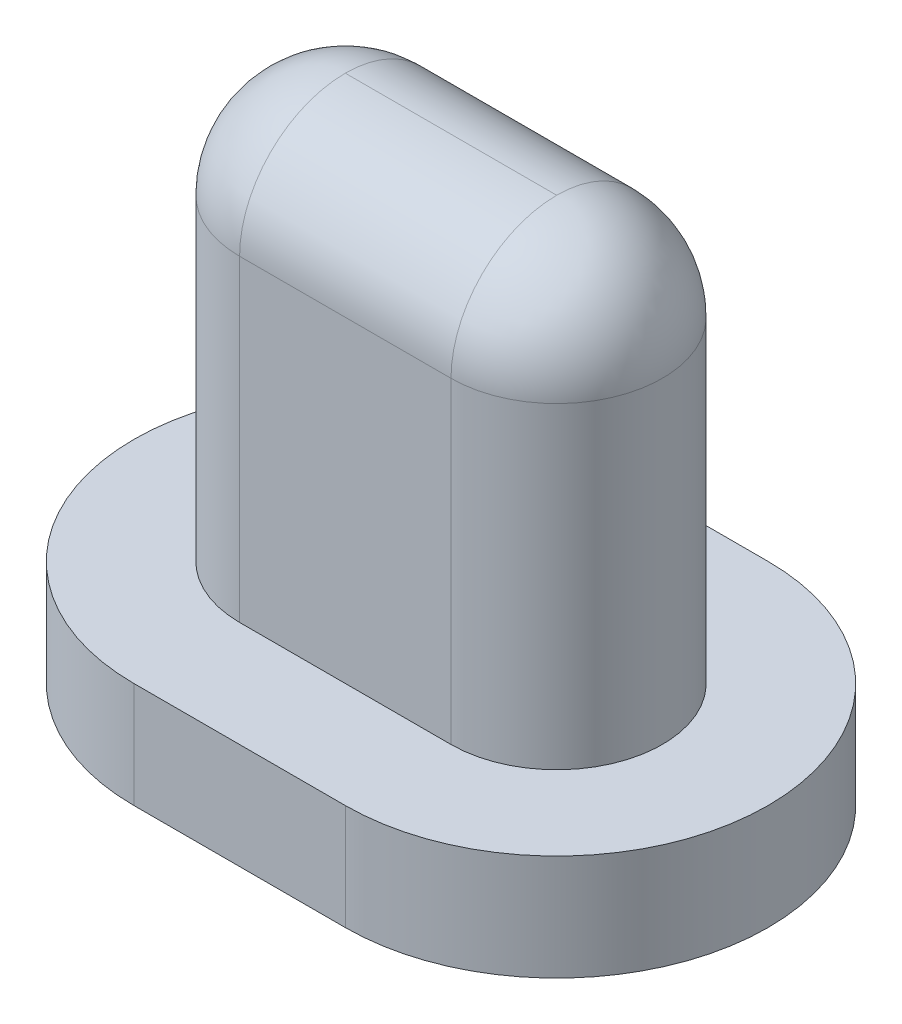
ISO-10303-21;
HEADER;
FILE_DESCRIPTION(('STEP AP214'),'2;1');
FILE_NAME('part.step','',(''),(''),'','','');
FILE_SCHEMA(('AUTOMOTIVE_DESIGN { 1 0 10303 214 1 1 1 1 }'));
ENDSEC;
DATA;
#1=APPLICATION_CONTEXT('core data for automotive mechanical design processes');
#2=APPLICATION_PROTOCOL_DEFINITION('international standard','automotive_design',2000,#1);
#3=PRODUCT_CONTEXT('',#1,'mechanical');
#4=PRODUCT('Part','Part','',(#3));
#5=PRODUCT_RELATED_PRODUCT_CATEGORY('part','',(#4));
#6=PRODUCT_DEFINITION_FORMATION('','',#4);
#7=PRODUCT_DEFINITION_CONTEXT('part definition',#1,'design');
#8=PRODUCT_DEFINITION('design','',#6,#7);
#9=PRODUCT_DEFINITION_SHAPE('','',#8);
#10=(LENGTH_UNIT() NAMED_UNIT(*) SI_UNIT(.MILLI.,.METRE.));
#11=(NAMED_UNIT(*) PLANE_ANGLE_UNIT() SI_UNIT($,.RADIAN.));
#12=(NAMED_UNIT(*) SI_UNIT($,.STERADIAN.) SOLID_ANGLE_UNIT());
#13=UNCERTAINTY_MEASURE_WITH_UNIT(LENGTH_MEASURE(1.E-05),#10,'distance_accuracy_value','');
#14=(GEOMETRIC_REPRESENTATION_CONTEXT(3) GLOBAL_UNCERTAINTY_ASSIGNED_CONTEXT((#13)) GLOBAL_UNIT_ASSIGNED_CONTEXT((#10,
#11,#12)) REPRESENTATION_CONTEXT('',''));
#15=CARTESIAN_POINT('',(0.,0.,0.));
#16=DIRECTION('',(0.,0.,1.));
#17=DIRECTION('',(1.,0.,0.));
#18=AXIS2_PLACEMENT_3D('',#15,#16,#17);
#19=CARTESIAN_POINT('',(0.,4.,0.));
#20=DIRECTION('',(0.,-1.,0.));
#21=DIRECTION('',(0.,0.,-1.));
#22=AXIS2_PLACEMENT_3D('',#19,#20,#21);
#23=CYLINDRICAL_SURFACE('',#22,1.);
#24=DIRECTION('',(0.,-1.,0.));
#25=VECTOR('',#24,1.);
#26=CARTESIAN_POINT('',(0.,4.,1.));
#27=LINE('',#26,#25);
#28=CARTESIAN_POINT('',(0.,3.,1.));
#29=VERTEX_POINT('',#28);
#30=CARTESIAN_POINT('',(0.,0.,1.));
#31=VERTEX_POINT('',#30);
#32=EDGE_CURVE('E119',#29,#31,#27,.T.);
#33=ORIENTED_EDGE('',*,*,#32,.F.);
#34=CARTESIAN_POINT('',(0.,3.,0.));
#35=DIRECTION('',(0.,-1.,0.));
#36=DIRECTION('',(0.,0.,-1.));
#37=AXIS2_PLACEMENT_3D('',#34,#35,#36);
#38=CIRCLE('',#37,1.);
#39=CARTESIAN_POINT('',(0.,3.,-1.));
#40=VERTEX_POINT('',#39);
#41=EDGE_CURVE('E108',#29,#40,#38,.T.);
#42=ORIENTED_EDGE('',*,*,#41,.T.);
#43=DIRECTION('',(0.,-1.,0.));
#44=VECTOR('',#43,1.);
#45=CARTESIAN_POINT('',(0.,4.,-1.));
#46=LINE('',#45,#44);
#47=CARTESIAN_POINT('',(0.,0.,-1.));
#48=VERTEX_POINT('',#47);
#49=EDGE_CURVE('E117',#40,#48,#46,.T.);
#50=ORIENTED_EDGE('',*,*,#49,.T.);
#51=CARTESIAN_POINT('',(0.,0.,0.));
#52=DIRECTION('',(0.,1.,0.));
#53=DIRECTION('',(0.,0.,1.));
#54=AXIS2_PLACEMENT_3D('',#51,#52,#53);
#55=CIRCLE('',#54,1.);
#56=EDGE_CURVE('E81',#48,#31,#55,.T.);
#57=ORIENTED_EDGE('',*,*,#56,.T.);
#58=EDGE_LOOP('',(#33,#42,#50,#57));
#59=FACE_BOUND('',#58,.T.);
#60=ADVANCED_FACE('F39',(#59),#23,.T.);
#61=CARTESIAN_POINT('',(0.,4.,1.));
#62=DIRECTION('',(0.,0.,-1.));
#63=DIRECTION('',(-1.,0.,0.));
#64=AXIS2_PLACEMENT_3D('',#61,#62,#63);
#65=PLANE('',#64);
#66=DIRECTION('',(0.,-1.,0.));
#67=VECTOR('',#66,1.);
#68=CARTESIAN_POINT('',(2.,4.,1.));
#69=LINE('',#68,#67);
#70=CARTESIAN_POINT('',(2.,3.,1.));
#71=VERTEX_POINT('',#70);
#72=CARTESIAN_POINT('',(2.,0.,1.));
#73=VERTEX_POINT('',#72);
#74=EDGE_CURVE('E124',#71,#73,#69,.T.);
#75=ORIENTED_EDGE('',*,*,#74,.F.);
#76=DIRECTION('',(1.,0.,0.));
#77=VECTOR('',#76,1.);
#78=CARTESIAN_POINT('',(0.,3.,1.));
#79=LINE('',#78,#77);
#80=EDGE_CURVE('E11',#71,#29,#79,.F.);
#81=ORIENTED_EDGE('',*,*,#80,.T.);
#82=ORIENTED_EDGE('',*,*,#32,.T.);
#83=DIRECTION('',(1.,0.,0.));
#84=VECTOR('',#83,1.);
#85=CARTESIAN_POINT('',(0.,0.,1.));
#86=LINE('',#85,#84);
#87=EDGE_CURVE('E147',#31,#73,#86,.T.);
#88=ORIENTED_EDGE('',*,*,#87,.T.);
#89=EDGE_LOOP('',(#75,#81,#82,#88));
#90=FACE_BOUND('',#89,.T.);
#91=ADVANCED_FACE('F162',(#90),#65,.F.);
#92=CARTESIAN_POINT('',(2.,4.,0.));
#93=DIRECTION('',(0.,-1.,0.));
#94=DIRECTION('',(0.,0.,-1.));
#95=AXIS2_PLACEMENT_3D('',#92,#93,#94);
#96=CYLINDRICAL_SURFACE('',#95,1.);
#97=DIRECTION('',(0.,-1.,0.));
#98=VECTOR('',#97,1.);
#99=CARTESIAN_POINT('',(2.,4.,-1.));
#100=LINE('',#99,#98);
#101=CARTESIAN_POINT('',(2.,3.,-1.));
#102=VERTEX_POINT('',#101);
#103=CARTESIAN_POINT('',(2.,0.,-1.));
#104=VERTEX_POINT('',#103);
#105=EDGE_CURVE('E115',#102,#104,#100,.T.);
#106=ORIENTED_EDGE('',*,*,#105,.F.);
#107=CARTESIAN_POINT('',(2.,3.,0.));
#108=DIRECTION('',(0.,-1.,0.));
#109=DIRECTION('',(0.,0.,-1.));
#110=AXIS2_PLACEMENT_3D('',#107,#108,#109);
#111=CIRCLE('',#110,1.);
#112=EDGE_CURVE('E50',#102,#71,#111,.T.);
#113=ORIENTED_EDGE('',*,*,#112,.T.);
#114=ORIENTED_EDGE('',*,*,#74,.T.);
#115=CARTESIAN_POINT('',(2.,0.,0.));
#116=DIRECTION('',(0.,1.,0.));
#117=DIRECTION('',(0.,0.,1.));
#118=AXIS2_PLACEMENT_3D('',#115,#116,#117);
#119=CIRCLE('',#118,1.);
#120=EDGE_CURVE('E122',#73,#104,#119,.T.);
#121=ORIENTED_EDGE('',*,*,#120,.T.);
#122=EDGE_LOOP('',(#106,#113,#114,#121));
#123=FACE_BOUND('',#122,.T.);
#124=ADVANCED_FACE('F121',(#123),#96,.T.);
#125=CARTESIAN_POINT('',(0.,4.,-1.));
#126=DIRECTION('',(0.,0.,1.));
#127=DIRECTION('',(1.,0.,0.));
#128=AXIS2_PLACEMENT_3D('',#125,#126,#127);
#129=PLANE('',#128);
#130=ORIENTED_EDGE('',*,*,#49,.F.);
#131=DIRECTION('',(-1.,0.,0.));
#132=VECTOR('',#131,1.);
#133=CARTESIAN_POINT('',(2.,3.,-1.));
#134=LINE('',#133,#132);
#135=EDGE_CURVE('E100',#40,#102,#134,.F.);
#136=ORIENTED_EDGE('',*,*,#135,.T.);
#137=ORIENTED_EDGE('',*,*,#105,.T.);
#138=DIRECTION('',(-1.,0.,0.));
#139=VECTOR('',#138,1.);
#140=CARTESIAN_POINT('',(0.,0.,-1.));
#141=LINE('',#140,#139);
#142=EDGE_CURVE('E129',#104,#48,#141,.T.);
#143=ORIENTED_EDGE('',*,*,#142,.T.);
#144=EDGE_LOOP('',(#130,#136,#137,#143));
#145=FACE_BOUND('',#144,.T.);
#146=ADVANCED_FACE('F113',(#145),#129,.F.);
#147=CARTESIAN_POINT('',(2.,3.,0.));
#148=DIRECTION('',(0.,1.,0.));
#149=DIRECTION('',(0.,0.,1.));
#150=AXIS2_PLACEMENT_3D('',#147,#148,#149);
#151=SPHERICAL_SURFACE('',#150,1.);
#152=CARTESIAN_POINT('',(2.,3.,0.));
#153=DIRECTION('',(-1.,0.,0.));
#154=DIRECTION('',(0.,0.,1.));
#155=AXIS2_PLACEMENT_3D('',#152,#153,#154);
#156=CIRCLE('',#155,1.);
#157=CARTESIAN_POINT('',(2.,4.,0.));
#158=VERTEX_POINT('',#157);
#159=EDGE_CURVE('E43',#71,#158,#156,.T.);
#160=ORIENTED_EDGE('',*,*,#159,.F.);
#161=ORIENTED_EDGE('',*,*,#112,.F.);
#162=CARTESIAN_POINT('',(2.,3.,0.));
#163=DIRECTION('',(-1.,0.,0.));
#164=DIRECTION('',(0.,0.,1.));
#165=AXIS2_PLACEMENT_3D('',#162,#163,#164);
#166=CIRCLE('',#165,1.);
#167=EDGE_CURVE('E96',#158,#102,#166,.T.);
#168=ORIENTED_EDGE('',*,*,#167,.F.);
#169=EDGE_LOOP('',(#160,#161,#168));
#170=FACE_BOUND('',#169,.T.);
#171=ADVANCED_FACE('F41',(#170),#151,.T.);
#172=CARTESIAN_POINT('',(0.,3.,0.));
#173=DIRECTION('',(-1.,0.,0.));
#174=DIRECTION('',(0.,0.,1.));
#175=AXIS2_PLACEMENT_3D('',#172,#173,#174);
#176=CYLINDRICAL_SURFACE('',#175,1.);
#177=CARTESIAN_POINT('',(0.,3.,0.));
#178=DIRECTION('',(-1.,0.,0.));
#179=DIRECTION('',(0.,0.,1.));
#180=AXIS2_PLACEMENT_3D('',#177,#178,#179);
#181=CIRCLE('',#180,1.);
#182=CARTESIAN_POINT('',(0.,4.,0.));
#183=VERTEX_POINT('',#182);
#184=EDGE_CURVE('E70',#29,#183,#181,.T.);
#185=ORIENTED_EDGE('',*,*,#184,.F.);
#186=ORIENTED_EDGE('',*,*,#80,.F.);
#187=ORIENTED_EDGE('',*,*,#159,.T.);
#188=DIRECTION('',(1.,0.,0.));
#189=VECTOR('',#188,1.);
#190=CARTESIAN_POINT('',(2.,4.,0.));
#191=LINE('',#190,#189);
#192=EDGE_CURVE('E101',#183,#158,#191,.T.);
#193=ORIENTED_EDGE('',*,*,#192,.F.);
#194=EDGE_LOOP('',(#185,#186,#187,#193));
#195=FACE_BOUND('',#194,.T.);
#196=ADVANCED_FACE('F164',(#195),#176,.T.);
#197=CARTESIAN_POINT('',(0.,3.,0.));
#198=DIRECTION('',(0.,1.,0.));
#199=DIRECTION('',(0.,0.,1.));
#200=AXIS2_PLACEMENT_3D('',#197,#198,#199);
#201=SPHERICAL_SURFACE('',#200,1.);
#202=ORIENTED_EDGE('',*,*,#41,.F.);
#203=ORIENTED_EDGE('',*,*,#184,.T.);
#204=CARTESIAN_POINT('',(0.,3.,0.));
#205=DIRECTION('',(1.,0.,0.));
#206=DIRECTION('',(0.,0.,-1.));
#207=AXIS2_PLACEMENT_3D('',#204,#205,#206);
#208=CIRCLE('',#207,1.);
#209=EDGE_CURVE('E138',#40,#183,#208,.T.);
#210=ORIENTED_EDGE('',*,*,#209,.F.);
#211=EDGE_LOOP('',(#202,#203,#210));
#212=FACE_BOUND('',#211,.T.);
#213=ADVANCED_FACE('F165',(#212),#201,.T.);
#214=CARTESIAN_POINT('',(0.,3.,0.));
#215=DIRECTION('',(1.,0.,0.));
#216=DIRECTION('',(0.,0.,-1.));
#217=AXIS2_PLACEMENT_3D('',#214,#215,#216);
#218=CYLINDRICAL_SURFACE('',#217,1.);
#219=ORIENTED_EDGE('',*,*,#167,.T.);
#220=ORIENTED_EDGE('',*,*,#135,.F.);
#221=ORIENTED_EDGE('',*,*,#209,.T.);
#222=ORIENTED_EDGE('',*,*,#192,.T.);
#223=EDGE_LOOP('',(#219,#220,#221,#222));
#224=FACE_BOUND('',#223,.T.);
#225=ADVANCED_FACE('F97',(#224),#218,.T.);
#226=CARTESIAN_POINT('',(0.,-1.,0.));
#227=DIRECTION('',(0.,1.,0.));
#228=DIRECTION('',(0.,0.,1.));
#229=AXIS2_PLACEMENT_3D('',#226,#227,#228);
#230=CYLINDRICAL_SURFACE('',#229,2.);
#231=CARTESIAN_POINT('',(0.,0.,0.));
#232=DIRECTION('',(0.,-1.,0.));
#233=DIRECTION('',(0.,0.,-1.));
#234=AXIS2_PLACEMENT_3D('',#231,#232,#233);
#235=CIRCLE('',#234,2.);
#236=CARTESIAN_POINT('',(0.,0.,2.));
#237=VERTEX_POINT('',#236);
#238=CARTESIAN_POINT('',(0.,0.,-2.));
#239=VERTEX_POINT('',#238);
#240=EDGE_CURVE('E232',#237,#239,#235,.T.);
#241=ORIENTED_EDGE('',*,*,#240,.T.);
#242=DIRECTION('',(0.,1.,0.));
#243=VECTOR('',#242,1.);
#244=CARTESIAN_POINT('',(0.,-1.,-2.));
#245=LINE('',#244,#243);
#246=CARTESIAN_POINT('',(0.,-1.,-2.));
#247=VERTEX_POINT('',#246);
#248=EDGE_CURVE('E141',#247,#239,#245,.T.);
#249=ORIENTED_EDGE('',*,*,#248,.F.);
#250=CARTESIAN_POINT('',(0.,-1.,0.));
#251=DIRECTION('',(0.,-1.,0.));
#252=DIRECTION('',(0.,0.,-1.));
#253=AXIS2_PLACEMENT_3D('',#250,#251,#252);
#254=CIRCLE('',#253,2.);
#255=CARTESIAN_POINT('',(0.,-1.,2.));
#256=VERTEX_POINT('',#255);
#257=EDGE_CURVE('E212',#256,#247,#254,.T.);
#258=ORIENTED_EDGE('',*,*,#257,.F.);
#259=DIRECTION('',(0.,1.,0.));
#260=VECTOR('',#259,1.);
#261=CARTESIAN_POINT('',(0.,-1.,2.));
#262=LINE('',#261,#260);
#263=EDGE_CURVE('E245',#256,#237,#262,.T.);
#264=ORIENTED_EDGE('',*,*,#263,.T.);
#265=EDGE_LOOP('',(#241,#249,#258,#264));
#266=FACE_BOUND('',#265,.T.);
#267=ADVANCED_FACE('F172',(#266),#230,.T.);
#268=CARTESIAN_POINT('',(0.,-1.,-2.));
#269=DIRECTION('',(0.,0.,1.));
#270=DIRECTION('',(1.,0.,0.));
#271=AXIS2_PLACEMENT_3D('',#268,#269,#270);
#272=PLANE('',#271);
#273=DIRECTION('',(1.,0.,0.));
#274=VECTOR('',#273,1.);
#275=CARTESIAN_POINT('',(0.,0.,-2.));
#276=LINE('',#275,#274);
#277=CARTESIAN_POINT('',(2.,0.,-2.));
#278=VERTEX_POINT('',#277);
#279=EDGE_CURVE('E256',#239,#278,#276,.T.);
#280=ORIENTED_EDGE('',*,*,#279,.T.);
#281=DIRECTION('',(0.,1.,0.));
#282=VECTOR('',#281,1.);
#283=CARTESIAN_POINT('',(2.,-1.,-2.));
#284=LINE('',#283,#282);
#285=CARTESIAN_POINT('',(2.,-1.,-2.));
#286=VERTEX_POINT('',#285);
#287=EDGE_CURVE('E235',#286,#278,#284,.T.);
#288=ORIENTED_EDGE('',*,*,#287,.F.);
#289=DIRECTION('',(1.,0.,0.));
#290=VECTOR('',#289,1.);
#291=CARTESIAN_POINT('',(0.,-1.,-2.));
#292=LINE('',#291,#290);
#293=EDGE_CURVE('E217',#247,#286,#292,.T.);
#294=ORIENTED_EDGE('',*,*,#293,.F.);
#295=ORIENTED_EDGE('',*,*,#248,.T.);
#296=EDGE_LOOP('',(#280,#288,#294,#295));
#297=FACE_BOUND('',#296,.T.);
#298=ADVANCED_FACE('F187',(#297),#272,.F.);
#299=CARTESIAN_POINT('',(2.,-1.,0.));
#300=DIRECTION('',(0.,1.,0.));
#301=DIRECTION('',(0.,0.,1.));
#302=AXIS2_PLACEMENT_3D('',#299,#300,#301);
#303=CYLINDRICAL_SURFACE('',#302,2.);
#304=CARTESIAN_POINT('',(2.,0.,0.));
#305=DIRECTION('',(0.,-1.,0.));
#306=DIRECTION('',(0.,0.,-1.));
#307=AXIS2_PLACEMENT_3D('',#304,#305,#306);
#308=CIRCLE('',#307,2.);
#309=CARTESIAN_POINT('',(2.,0.,2.));
#310=VERTEX_POINT('',#309);
#311=EDGE_CURVE('E253',#278,#310,#308,.T.);
#312=ORIENTED_EDGE('',*,*,#311,.T.);
#313=DIRECTION('',(0.,1.,0.));
#314=VECTOR('',#313,1.);
#315=CARTESIAN_POINT('',(2.,-1.,2.));
#316=LINE('',#315,#314);
#317=CARTESIAN_POINT('',(2.,-1.,2.));
#318=VERTEX_POINT('',#317);
#319=EDGE_CURVE('E238',#318,#310,#316,.T.);
#320=ORIENTED_EDGE('',*,*,#319,.F.);
#321=CARTESIAN_POINT('',(2.,-1.,0.));
#322=DIRECTION('',(0.,-1.,0.));
#323=DIRECTION('',(0.,0.,-1.));
#324=AXIS2_PLACEMENT_3D('',#321,#322,#323);
#325=CIRCLE('',#324,2.);
#326=EDGE_CURVE('E263',#286,#318,#325,.T.);
#327=ORIENTED_EDGE('',*,*,#326,.F.);
#328=ORIENTED_EDGE('',*,*,#287,.T.);
#329=EDGE_LOOP('',(#312,#320,#327,#328));
#330=FACE_BOUND('',#329,.T.);
#331=ADVANCED_FACE('F191',(#330),#303,.T.);
#332=CARTESIAN_POINT('',(2.,-1.,2.));
#333=DIRECTION('',(0.,0.,-1.));
#334=DIRECTION('',(-1.,0.,0.));
#335=AXIS2_PLACEMENT_3D('',#332,#333,#334);
#336=PLANE('',#335);
#337=DIRECTION('',(-1.,0.,0.));
#338=VECTOR('',#337,1.);
#339=CARTESIAN_POINT('',(2.,0.,2.));
#340=LINE('',#339,#338);
#341=EDGE_CURVE('E226',#310,#237,#340,.T.);
#342=ORIENTED_EDGE('',*,*,#341,.T.);
#343=ORIENTED_EDGE('',*,*,#263,.F.);
#344=DIRECTION('',(-1.,0.,0.));
#345=VECTOR('',#344,1.);
#346=CARTESIAN_POINT('',(2.,-1.,2.));
#347=LINE('',#346,#345);
#348=EDGE_CURVE('E220',#318,#256,#347,.T.);
#349=ORIENTED_EDGE('',*,*,#348,.F.);
#350=ORIENTED_EDGE('',*,*,#319,.T.);
#351=EDGE_LOOP('',(#342,#343,#349,#350));
#352=FACE_BOUND('',#351,.T.);
#353=ADVANCED_FACE('F195',(#352),#336,.F.);
#354=CARTESIAN_POINT('',(0.,-1.,0.));
#355=DIRECTION('',(0.,-1.,0.));
#356=DIRECTION('',(0.,0.,-1.));
#357=AXIS2_PLACEMENT_3D('',#354,#355,#356);
#358=PLANE('',#357);
#359=ORIENTED_EDGE('',*,*,#257,.T.);
#360=ORIENTED_EDGE('',*,*,#293,.T.);
#361=ORIENTED_EDGE('',*,*,#326,.T.);
#362=ORIENTED_EDGE('',*,*,#348,.T.);
#363=EDGE_LOOP('',(#359,#360,#361,#362));
#364=FACE_BOUND('',#363,.T.);
#365=ADVANCED_FACE('F199',(#364),#358,.T.);
#366=CARTESIAN_POINT('',(0.,0.,0.));
#367=DIRECTION('',(0.,-1.,0.));
#368=DIRECTION('',(0.,0.,-1.));
#369=AXIS2_PLACEMENT_3D('',#366,#367,#368);
#370=PLANE('',#369);
#371=ORIENTED_EDGE('',*,*,#56,.F.);
#372=ORIENTED_EDGE('',*,*,#142,.F.);
#373=ORIENTED_EDGE('',*,*,#120,.F.);
#374=ORIENTED_EDGE('',*,*,#87,.F.);
#375=EDGE_LOOP('',(#371,#372,#373,#374));
#376=FACE_BOUND('',#375,.T.);
#377=ORIENTED_EDGE('',*,*,#240,.F.);
#378=ORIENTED_EDGE('',*,*,#341,.F.);
#379=ORIENTED_EDGE('',*,*,#311,.F.);
#380=ORIENTED_EDGE('',*,*,#279,.F.);
#381=EDGE_LOOP('',(#377,#378,#379,#380));
#382=FACE_BOUND('',#381,.T.);
#383=ADVANCED_FACE('F159',(#376,#382),#370,.F.);
#384=CLOSED_SHELL('',(#60,#91,#124,#146,#171,#196,#213,#225,#267,#298,#331,#353,#365,#383));
#385=MANIFOLD_SOLID_BREP('B2',#384);
#386=ADVANCED_BREP_SHAPE_REPRESENTATION('',(#18,#385),#14);
#387=SHAPE_DEFINITION_REPRESENTATION(#9,#386);
ENDSEC;
END-ISO-10303-21;
